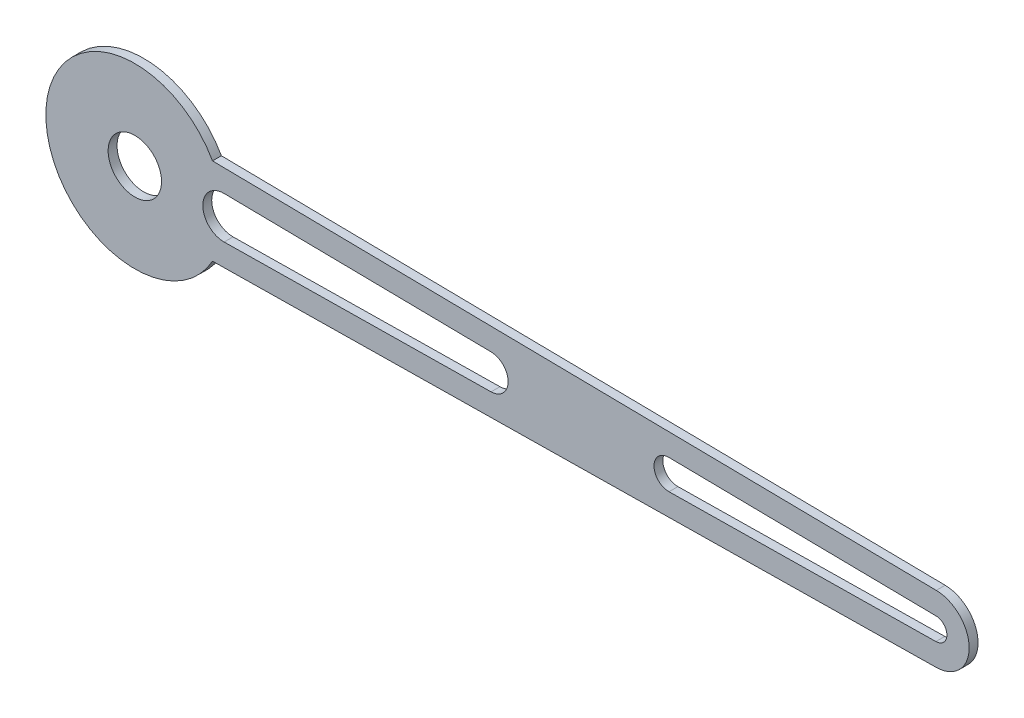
from build123d import *

# Parameters (mm, degrees)
SKETCH4_R          = 0.3
BASE_EXTRUDE_DEPTH = 0.1


with BuildPart() as part:
    # Sketch4 → Base-Extrude (new body)
    with BuildSketch(Plane.XY):
        with BuildLine():
            Line((0.872886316, 0.487923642), (9.005208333, 0.374963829))
            ThreePointArc((9.005208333, 0.374963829), (9.375, 0), (9.005208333, -0.374963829))
            Line((9.005208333, -0.374963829), (0.872886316, -0.487923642))
            ThreePointArc((0.872886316, -0.487923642), (-1, 0), (0.872886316, 0.487923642))
        make_face()
        Circle(SKETCH4_R, mode=Mode.SUBTRACT)
        with BuildLine():
            Line((1.003279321, 0.236088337), (4.002700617, 0.194425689))
            ThreePointArc((4.002700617, 0.194425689), (4.194444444, 0), (4.002700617, -0.194425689))
            Line((4.002700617, -0.194425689), (1.003279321, -0.236088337))
            ThreePointArc((1.003279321, -0.236088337), (0.763888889, 0), (1.003279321, 0.236088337))
        make_face(mode=Mode.SUBTRACT)
        with BuildLine():
            Line((6.002314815, -0.166650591), (9.001736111, -0.124987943))
            ThreePointArc((9.001736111, -0.124987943), (9.125, 0), (9.001736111, 0.124987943))
            Line((9.001736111, 0.124987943), (6.002314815, 0.166650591))
            ThreePointArc((6.002314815, 0.166650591), (5.833333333, 0), (6.002314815, -0.166650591))
        make_face(mode=Mode.SUBTRACT)
    extrude(amount=BASE_EXTRUDE_DEPTH)


solid = part.part
